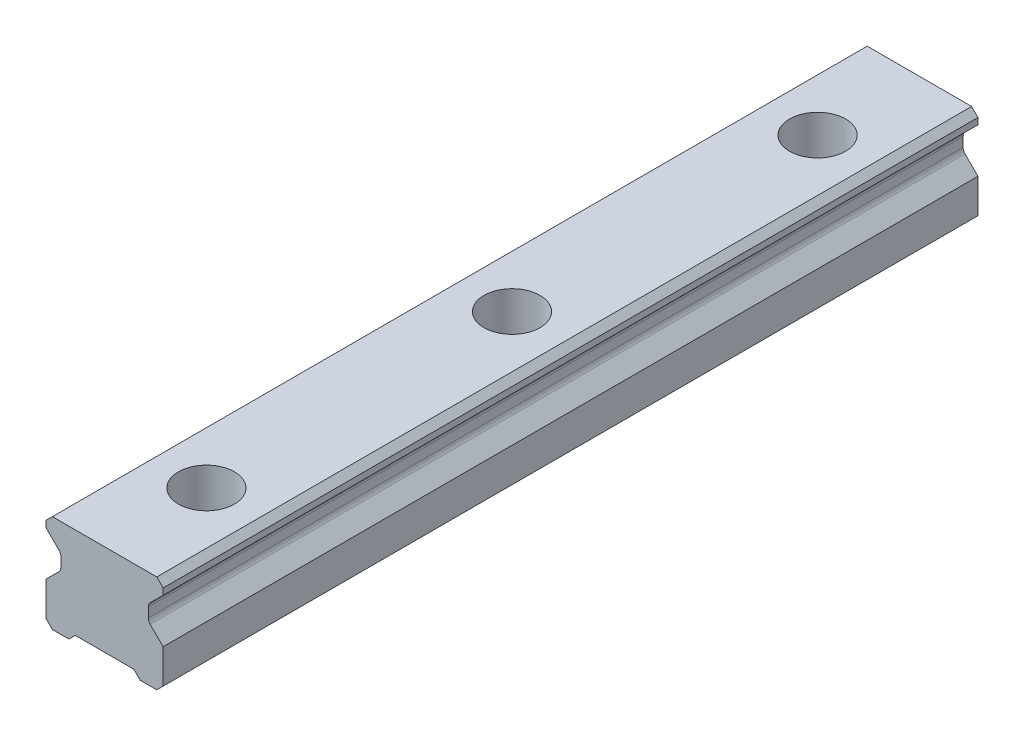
from build123d import *

# Parameters (mm, degrees)
SKETCH1_W           = 23
SKETCH1_H           = 19.2
BOSS_EXTRUDE1_DEPTH = 80
CUT_EXTRUDE1_DEPTH  = 162.557698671
CHAMFER1_SIZE       = 1.25
FILLET1_R           = 1.25
CUT_EXTRUDE2_DEPTH  = 162.557698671
SKETCH4_R           = 5.5
SKETCH4_R_2         = 3.5
CUT_EXTRUDE3_DEPTH  = 9
SKETCH4_2_R         = 3.5
CUT_EXTRUDE4_DEPTH  = 84.071595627
LPATTERN1_COUNT     = 3
LPATTERN1_PITCH     = 60


with BuildPart() as part:
    # Sketch1 → Boss-Extrude1 (new, symmetric)
    with BuildSketch(Plane.XY):
        with Locations((0, 9.6)):
            Rectangle(SKETCH1_W, SKETCH1_H)
    extrude(amount=BOSS_EXTRUDE1_DEPTH, both=True)

    # Sketch2 → Cut-Extrude1 (cut, through all)
    with BuildSketch(Plane.XY.offset(80)):
        Polygon((-11.5, 16.7), (-11.5, 7.95), (-8.583333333, 10.866666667), (-8.583333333, 13.783333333), align=None)
        Polygon((8.583333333, 13.783333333), (11.5, 16.7), (11.5, 7.95), (8.583333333, 10.866666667), align=None)
    extrude(amount=-CUT_EXTRUDE1_DEPTH, mode=Mode.SUBTRACT)

    # Chamfer1
    chamfer1_edges = [part.edges().sort_by_distance(p)[0] for p in [
        (-11.5, 19.2, 0),
        (11.5, 19.2, 0),
        (11.5, 0, 0),
        (-11.5, 0, 0),
    ]]
    chamfer(chamfer1_edges, length=CHAMFER1_SIZE)

    # Fillet1
    fillet1_edges = [part.edges().sort_by_distance(p)[0] for p in [
        (-8.583333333, 13.783333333, 0),
        (-8.583333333, 10.866666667, 0),
        (8.583333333, 10.866666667, 0),
        (8.583333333, 13.783333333, 0),
    ]]
    fillet(fillet1_edges, radius=FILLET1_R)

    # Sketch3 → Cut-Extrude2 (cut, through all)
    with BuildSketch(Plane.XY.offset(80)):
        Polygon((-7, 0), (-5.75, 1.25), (5.75, 1.25), (7, 0), align=None)
    extrude(amount=-CUT_EXTRUDE2_DEPTH, mode=Mode.SUBTRACT)

    # Sketch4 → Cut-Extrude3 (cut)
    with BuildSketch(Plane(origin=(0, 19.2, 0), x_dir=(1, 0, 0), z_dir=(0, 1, 0))):
        with Locations(Location((0, -60, 0), (0, 0, 270))):
            Circle(SKETCH4_R)
        with Locations(Location((0, -60, 0), (0, 0, 270))):
            Circle(SKETCH4_R_2, mode=Mode.SUBTRACT)
    cut_extrude3 = extrude(amount=-CUT_EXTRUDE3_DEPTH, mode=Mode.SUBTRACT)

    # Sketch4_2 → Cut-Extrude4 (cut, through all)
    with BuildSketch(Plane(origin=(0, 19.2, 0), x_dir=(1, 0, 0), z_dir=(0, 1, 0))):
        with Locations(Location((0, -60, 0), (0, 0, 270))):
            Circle(SKETCH4_2_R)
    cut_extrude4 = extrude(amount=-CUT_EXTRUDE4_DEPTH, mode=Mode.SUBTRACT)

    # LPattern1: Cut-Extrude3, Cut-Extrude4 ×3
    with Locations(*[(0, 0, -i * LPATTERN1_PITCH) for i in range(1, LPATTERN1_COUNT)]):
        add(cut_extrude3, mode=Mode.SUBTRACT)
        add(cut_extrude4, mode=Mode.SUBTRACT)


solid = part.part
